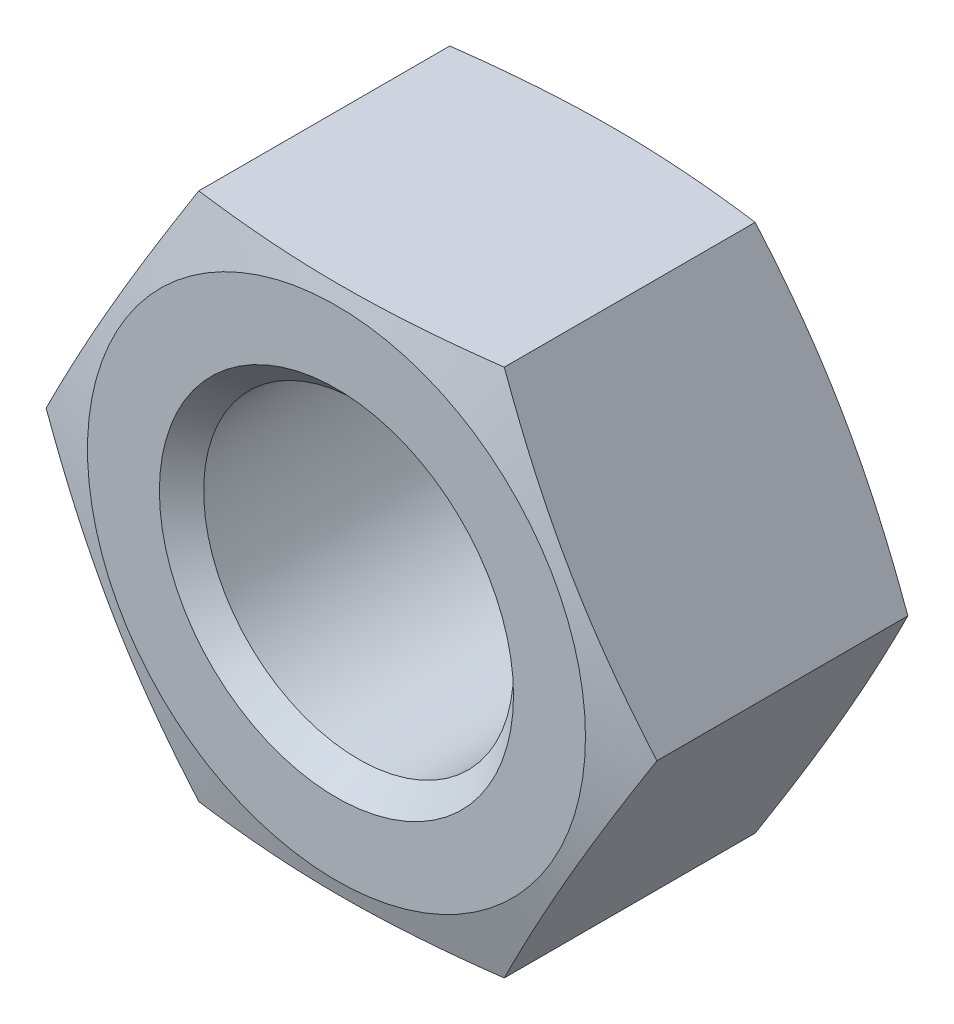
from build123d import *

# Parameters (mm, degrees)
BOSS_EXTRU_1_DEPTH      = 6.35
TROU_TARAUD_M161_D      = 14
TROU_TARAUD_M161_DEPTH  = 40
TROU_TARAUD_M161_TIP    = 4.206024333
ESQUISSE4_OUTSIDE_W     = 132.122
ESQUISSE4_OUTSIDE_H     = 128.424
ESQUISSE4_OUTSIDE_R     = 11.25
ENL_V_MAT_EXTRU_1_DEPTH = 12.7
ENL_V_MAT_EXTRU_1_DRAFT = -75
ESQUISSE5_OUTSIDE_W     = 132.122
ESQUISSE5_OUTSIDE_H     = 128.424
ESQUISSE5_OUTSIDE_R     = 11.25
ENL_V_MAT_EXTRU_2_DEPTH = 12.7
ENL_V_MAT_EXTRU_2_DRAFT = -75
CHANFREIN1_SIZE         = 1


with BuildPart() as part:
    # Esquisse1 → Boss.-Extru.1 (new, symmetric)
    with BuildSketch(Plane.XY):
        Polygon((6.899335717, -11.95), (13.798671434, 0), (6.899335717, 11.95), (-6.899335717, 11.95), (-13.798671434, 0), (-6.899335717, -11.95), align=None)
    extrude(amount=BOSS_EXTRU_1_DEPTH, both=True)

    # Trou taraud_ M161
    with Locations(Plane.XY.offset(6.35)):
        with Locations((0, 0)):
            Hole(TROU_TARAUD_M161_D / 2, depth=TROU_TARAUD_M161_DEPTH)
            with Locations((0, 0, -(TROU_TARAUD_M161_DEPTH + TROU_TARAUD_M161_TIP / 2))):  # 118° drill point
                Cone(0, TROU_TARAUD_M161_D / 2, TROU_TARAUD_M161_TIP, mode=Mode.SUBTRACT)


with BuildPart() as enl_v_mat_extru_1_tool:
    # Esquisse4 outside → Enl_v. mat.-Extru.1 (with draft: the straight prism first)
    with BuildSketch(Plane.XY.offset(6.35)):
        Rectangle(ESQUISSE4_OUTSIDE_W, ESQUISSE4_OUTSIDE_H)
        Circle(ESQUISSE4_OUTSIDE_R, mode=Mode.SUBTRACT)
    extrude(amount=-ENL_V_MAT_EXTRU_1_DEPTH)
    # Enl_v. mat.-Extru.1: the draft: its side faces are tilted about the plane it starts from
    enl_v_mat_extru_1_sides = [enl_v_mat_extru_1_tool.faces().sort_by_distance(p)[0] for p in [
        (0, -64.212, 0),
        (66.061, 0, 0),
        (0, 64.212, 0),
        (-66.061, 0, 0),
        (-11.25, 0, 0),
    ]]
    draft(enl_v_mat_extru_1_sides, Plane.XY.offset(6.35), ENL_V_MAT_EXTRU_1_DRAFT)


with BuildPart() as part_1:
    add(part.part)

    # Enl_v. mat.-Extru.1: cut by enl_v_mat_extru_1_tool
    add(enl_v_mat_extru_1_tool.part, mode=Mode.SUBTRACT)


with BuildPart() as enl_v_mat_extru_2_tool:
    # Esquisse5 outside → Enl_v. mat.-Extru.2 (with draft: the straight prism first)
    with BuildSketch(Plane(origin=(0, 0, -6.35), x_dir=(-1, 0, 0), z_dir=(0, 0, -1))):
        Rectangle(ESQUISSE5_OUTSIDE_W, ESQUISSE5_OUTSIDE_H)
        Circle(ESQUISSE5_OUTSIDE_R, mode=Mode.SUBTRACT)
    extrude(amount=-ENL_V_MAT_EXTRU_2_DEPTH)
    # Enl_v. mat.-Extru.2: the draft: its side faces are tilted about the plane it starts from
    enl_v_mat_extru_2_sides = [enl_v_mat_extru_2_tool.faces().sort_by_distance(p)[0] for p in [
        (0, -64.212, 0),
        (-66.061, 0, 0),
        (0, 64.212, 0),
        (66.061, 0, 0),
        (11.25, 0, 0),
    ]]
    draft(enl_v_mat_extru_2_sides, Plane(origin=(0, 0, -6.35), x_dir=(-1, 0, 0), z_dir=(0, 0, -1)), ENL_V_MAT_EXTRU_2_DRAFT)


with BuildPart() as part_2:
    add(part_1.part)

    # Enl_v. mat.-Extru.2: cut by enl_v_mat_extru_2_tool
    add(enl_v_mat_extru_2_tool.part, mode=Mode.SUBTRACT)

    # Chanfrein1
    chanfrein1_edges = [part_2.edges().sort_by_distance(p)[0] for p in [
        (7, 0, -6.35),
        (7, 0, 6.35),
    ]]
    chamfer(chanfrein1_edges, length=CHANFREIN1_SIZE)


solid = part_2.part
